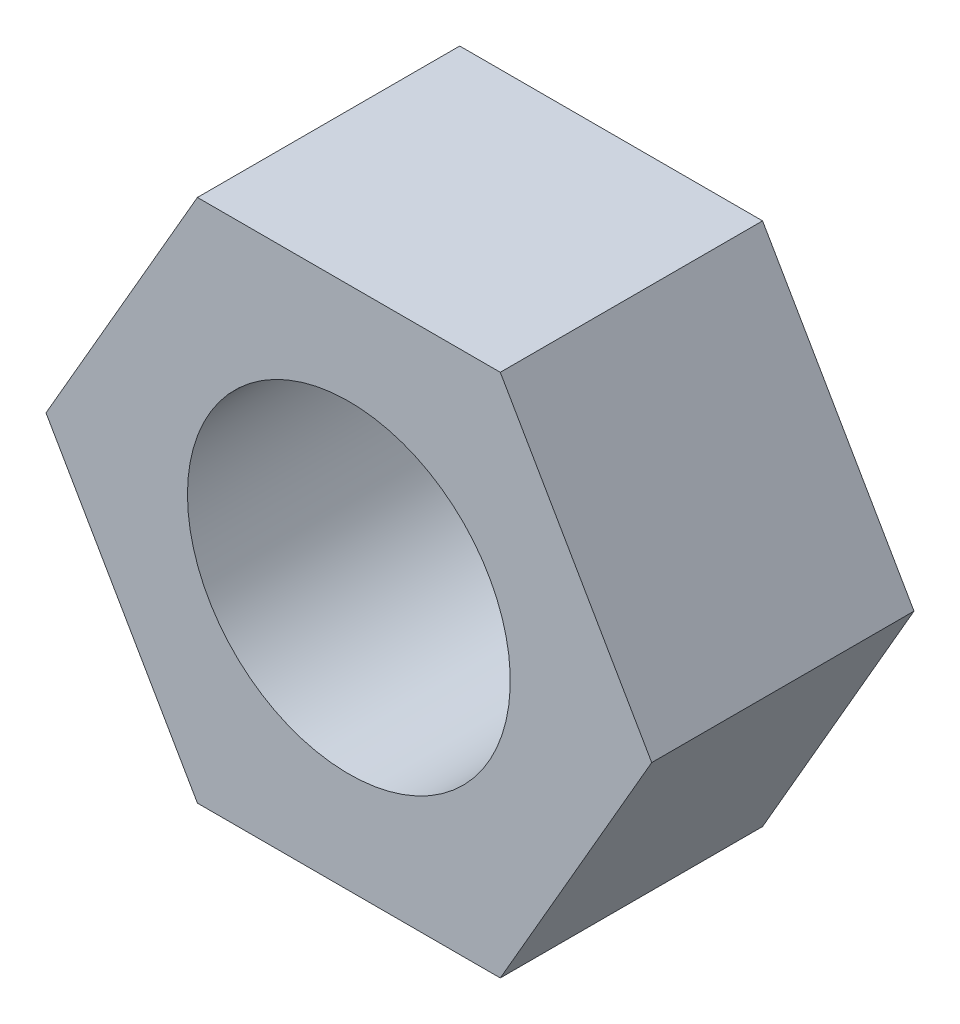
ISO-10303-21;
HEADER;
FILE_DESCRIPTION(('STEP AP214'),'2;1');
FILE_NAME('part.step','',(''),(''),'','','');
FILE_SCHEMA(('AUTOMOTIVE_DESIGN { 1 0 10303 214 1 1 1 1 }'));
ENDSEC;
DATA;
#1=APPLICATION_CONTEXT('core data for automotive mechanical design processes');
#2=APPLICATION_PROTOCOL_DEFINITION('international standard','automotive_design',2000,#1);
#3=PRODUCT_CONTEXT('',#1,'mechanical');
#4=PRODUCT('Part','Part','',(#3));
#5=PRODUCT_RELATED_PRODUCT_CATEGORY('part','',(#4));
#6=PRODUCT_DEFINITION_FORMATION('','',#4);
#7=PRODUCT_DEFINITION_CONTEXT('part definition',#1,'design');
#8=PRODUCT_DEFINITION('design','',#6,#7);
#9=PRODUCT_DEFINITION_SHAPE('','',#8);
#10=(LENGTH_UNIT() NAMED_UNIT(*) SI_UNIT(.MILLI.,.METRE.));
#11=(NAMED_UNIT(*) PLANE_ANGLE_UNIT() SI_UNIT($,.RADIAN.));
#12=(NAMED_UNIT(*) SI_UNIT($,.STERADIAN.) SOLID_ANGLE_UNIT());
#13=UNCERTAINTY_MEASURE_WITH_UNIT(LENGTH_MEASURE(1.E-05),#10,'distance_accuracy_value','');
#14=(GEOMETRIC_REPRESENTATION_CONTEXT(3) GLOBAL_UNCERTAINTY_ASSIGNED_CONTEXT((#13)) GLOBAL_UNIT_ASSIGNED_CONTEXT((#10,
#11,#12)) REPRESENTATION_CONTEXT('',''));
#15=CARTESIAN_POINT('',(0.,0.,0.));
#16=DIRECTION('',(0.,0.,1.));
#17=DIRECTION('',(1.,0.,0.));
#18=AXIS2_PLACEMENT_3D('',#15,#16,#17);
#19=CARTESIAN_POINT('',(5.62916512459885,-3.25,6.5));
#20=DIRECTION('',(-0.866025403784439,0.5,0.));
#21=DIRECTION('',(-0.5,-0.866025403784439,0.));
#22=AXIS2_PLACEMENT_3D('',#19,#20,#21);
#23=PLANE('',#22);
#24=DIRECTION('',(0.5,0.866025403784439,0.));
#25=VECTOR('',#24,1.);
#26=CARTESIAN_POINT('',(5.62916512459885,-3.25,0.));
#27=LINE('',#26,#25);
#28=CARTESIAN_POINT('',(3.75277674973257,-6.5,0.));
#29=VERTEX_POINT('',#28);
#30=CARTESIAN_POINT('',(7.50555349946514,0.,0.));
#31=VERTEX_POINT('',#30);
#32=EDGE_CURVE('E122',#29,#31,#27,.T.);
#33=ORIENTED_EDGE('',*,*,#32,.T.);
#34=DIRECTION('',(0.,0.,-1.));
#35=VECTOR('',#34,1.);
#36=CARTESIAN_POINT('',(7.50555349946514,0.,6.5));
#37=LINE('',#36,#35);
#38=CARTESIAN_POINT('',(7.50555349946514,0.,6.5));
#39=VERTEX_POINT('',#38);
#40=EDGE_CURVE('E11',#39,#31,#37,.T.);
#41=ORIENTED_EDGE('',*,*,#40,.F.);
#42=DIRECTION('',(0.5,0.866025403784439,0.));
#43=VECTOR('',#42,1.);
#44=CARTESIAN_POINT('',(5.62916512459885,-3.25,6.5));
#45=LINE('',#44,#43);
#46=CARTESIAN_POINT('',(3.75277674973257,-6.5,6.5));
#47=VERTEX_POINT('',#46);
#48=EDGE_CURVE('E145',#47,#39,#45,.T.);
#49=ORIENTED_EDGE('',*,*,#48,.F.);
#50=DIRECTION('',(0.,0.,-1.));
#51=VECTOR('',#50,1.);
#52=CARTESIAN_POINT('',(3.75277674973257,-6.5,6.5));
#53=LINE('',#52,#51);
#54=EDGE_CURVE('E115',#47,#29,#53,.T.);
#55=ORIENTED_EDGE('',*,*,#54,.T.);
#56=EDGE_LOOP('',(#33,#41,#49,#55));
#57=FACE_BOUND('',#56,.T.);
#58=ADVANCED_FACE('F34',(#57),#23,.F.);
#59=CARTESIAN_POINT('',(5.62916512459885,3.25,6.5));
#60=DIRECTION('',(-0.866025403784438,-0.5,0.));
#61=DIRECTION('',(0.5,-0.866025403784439,0.));
#62=AXIS2_PLACEMENT_3D('',#59,#60,#61);
#63=PLANE('',#62);
#64=DIRECTION('',(-0.5,0.866025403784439,0.));
#65=VECTOR('',#64,1.);
#66=CARTESIAN_POINT('',(5.62916512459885,3.25,0.));
#67=LINE('',#66,#65);
#68=CARTESIAN_POINT('',(3.75277674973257,6.5,0.));
#69=VERTEX_POINT('',#68);
#70=EDGE_CURVE('E125',#31,#69,#67,.T.);
#71=ORIENTED_EDGE('',*,*,#70,.T.);
#72=DIRECTION('',(0.,0.,-1.));
#73=VECTOR('',#72,1.);
#74=CARTESIAN_POINT('',(3.75277674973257,6.5,6.5));
#75=LINE('',#74,#73);
#76=CARTESIAN_POINT('',(3.75277674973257,6.5,6.5));
#77=VERTEX_POINT('',#76);
#78=EDGE_CURVE('E43',#77,#69,#75,.T.);
#79=ORIENTED_EDGE('',*,*,#78,.F.);
#80=DIRECTION('',(-0.5,0.866025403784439,0.));
#81=VECTOR('',#80,1.);
#82=CARTESIAN_POINT('',(5.62916512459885,3.25,6.5));
#83=LINE('',#82,#81);
#84=EDGE_CURVE('E88',#39,#77,#83,.T.);
#85=ORIENTED_EDGE('',*,*,#84,.F.);
#86=ORIENTED_EDGE('',*,*,#40,.T.);
#87=EDGE_LOOP('',(#71,#79,#85,#86));
#88=FACE_BOUND('',#87,.T.);
#89=ADVANCED_FACE('F159',(#88),#63,.F.);
#90=CARTESIAN_POINT('',(0.,6.5,6.5));
#91=DIRECTION('',(0.,-1.,0.));
#92=DIRECTION('',(1.,0.,0.));
#93=AXIS2_PLACEMENT_3D('',#90,#91,#92);
#94=PLANE('',#93);
#95=DIRECTION('',(-1.,0.,0.));
#96=VECTOR('',#95,1.);
#97=CARTESIAN_POINT('',(0.,6.5,0.));
#98=LINE('',#97,#96);
#99=CARTESIAN_POINT('',(-3.75277674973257,6.5,0.));
#100=VERTEX_POINT('',#99);
#101=EDGE_CURVE('E127',#69,#100,#98,.T.);
#102=ORIENTED_EDGE('',*,*,#101,.T.);
#103=DIRECTION('',(0.,0.,-1.));
#104=VECTOR('',#103,1.);
#105=CARTESIAN_POINT('',(-3.75277674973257,6.5,6.5));
#106=LINE('',#105,#104);
#107=CARTESIAN_POINT('',(-3.75277674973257,6.5,6.5));
#108=VERTEX_POINT('',#107);
#109=EDGE_CURVE('E110',#108,#100,#106,.T.);
#110=ORIENTED_EDGE('',*,*,#109,.F.);
#111=DIRECTION('',(-1.,0.,0.));
#112=VECTOR('',#111,1.);
#113=CARTESIAN_POINT('',(0.,6.5,6.5));
#114=LINE('',#113,#112);
#115=EDGE_CURVE('E101',#77,#108,#114,.T.);
#116=ORIENTED_EDGE('',*,*,#115,.F.);
#117=ORIENTED_EDGE('',*,*,#78,.T.);
#118=EDGE_LOOP('',(#102,#110,#116,#117));
#119=FACE_BOUND('',#118,.T.);
#120=ADVANCED_FACE('F138',(#119),#94,.F.);
#121=CARTESIAN_POINT('',(-5.62916512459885,3.24999999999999,6.5));
#122=DIRECTION('',(0.866025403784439,-0.499999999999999,0.));
#123=DIRECTION('',(0.499999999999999,0.866025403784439,0.));
#124=AXIS2_PLACEMENT_3D('',#121,#122,#123);
#125=PLANE('',#124);
#126=DIRECTION('',(-0.499999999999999,-0.866025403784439,0.));
#127=VECTOR('',#126,1.);
#128=CARTESIAN_POINT('',(-5.62916512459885,3.24999999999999,0.));
#129=LINE('',#128,#127);
#130=CARTESIAN_POINT('',(-7.50555349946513,0.,0.));
#131=VERTEX_POINT('',#130);
#132=EDGE_CURVE('E109',#100,#131,#129,.T.);
#133=ORIENTED_EDGE('',*,*,#132,.T.);
#134=DIRECTION('',(0.,0.,-1.));
#135=VECTOR('',#134,1.);
#136=CARTESIAN_POINT('',(-7.50555349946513,0.,6.5));
#137=LINE('',#136,#135);
#138=CARTESIAN_POINT('',(-7.50555349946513,0.,6.5));
#139=VERTEX_POINT('',#138);
#140=EDGE_CURVE('E106',#139,#131,#137,.T.);
#141=ORIENTED_EDGE('',*,*,#140,.F.);
#142=DIRECTION('',(-0.499999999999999,-0.866025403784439,0.));
#143=VECTOR('',#142,1.);
#144=CARTESIAN_POINT('',(-5.62916512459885,3.24999999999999,6.5));
#145=LINE('',#144,#143);
#146=EDGE_CURVE('E95',#108,#139,#145,.T.);
#147=ORIENTED_EDGE('',*,*,#146,.F.);
#148=ORIENTED_EDGE('',*,*,#109,.T.);
#149=EDGE_LOOP('',(#133,#141,#147,#148));
#150=FACE_BOUND('',#149,.T.);
#151=ADVANCED_FACE('F107',(#150),#125,.F.);
#152=CARTESIAN_POINT('',(-5.62916512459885,-3.25,6.5));
#153=DIRECTION('',(0.866025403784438,0.5,0.));
#154=DIRECTION('',(-0.5,0.866025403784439,0.));
#155=AXIS2_PLACEMENT_3D('',#152,#153,#154);
#156=PLANE('',#155);
#157=DIRECTION('',(0.5,-0.866025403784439,0.));
#158=VECTOR('',#157,1.);
#159=CARTESIAN_POINT('',(-5.62916512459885,-3.25,0.));
#160=LINE('',#159,#158);
#161=CARTESIAN_POINT('',(-3.75277674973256,-6.5,0.));
#162=VERTEX_POINT('',#161);
#163=EDGE_CURVE('E74',#131,#162,#160,.T.);
#164=ORIENTED_EDGE('',*,*,#163,.T.);
#165=DIRECTION('',(0.,0.,-1.));
#166=VECTOR('',#165,1.);
#167=CARTESIAN_POINT('',(-3.75277674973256,-6.5,6.5));
#168=LINE('',#167,#166);
#169=CARTESIAN_POINT('',(-3.75277674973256,-6.5,6.5));
#170=VERTEX_POINT('',#169);
#171=EDGE_CURVE('E111',#170,#162,#168,.T.);
#172=ORIENTED_EDGE('',*,*,#171,.F.);
#173=DIRECTION('',(0.5,-0.866025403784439,0.));
#174=VECTOR('',#173,1.);
#175=CARTESIAN_POINT('',(-5.62916512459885,-3.25,6.5));
#176=LINE('',#175,#174);
#177=EDGE_CURVE('E99',#139,#170,#176,.T.);
#178=ORIENTED_EDGE('',*,*,#177,.F.);
#179=ORIENTED_EDGE('',*,*,#140,.T.);
#180=EDGE_LOOP('',(#164,#172,#178,#179));
#181=FACE_BOUND('',#180,.T.);
#182=ADVANCED_FACE('F113',(#181),#156,.F.);
#183=CARTESIAN_POINT('',(0.,0.,6.5));
#184=DIRECTION('',(0.,0.,-1.));
#185=DIRECTION('',(-1.,0.,0.));
#186=AXIS2_PLACEMENT_3D('',#183,#184,#185);
#187=CYLINDRICAL_SURFACE('',#186,4.);
#188=CARTESIAN_POINT('',(0.,0.,6.5));
#189=DIRECTION('',(0.,0.,1.));
#190=DIRECTION('',(1.,0.,0.));
#191=AXIS2_PLACEMENT_3D('',#188,#189,#190);
#192=CIRCLE('',#191,4.);
#193=CARTESIAN_POINT('',(-4.,0.,6.5));
#194=VERTEX_POINT('',#193);
#195=EDGE_CURVE('E132',#194,#194,#192,.T.);
#196=CARTESIAN_POINT('',(0.,0.,0.));
#197=DIRECTION('',(0.,0.,1.));
#198=DIRECTION('',(1.,0.,0.));
#199=AXIS2_PLACEMENT_3D('',#196,#197,#198);
#200=CIRCLE('',#199,4.);
#201=CARTESIAN_POINT('',(-4.,0.,0.));
#202=VERTEX_POINT('',#201);
#203=EDGE_CURVE('E119',#202,#202,#200,.T.);
#204=CARTESIAN_POINT('',(-4.,0.,6.5));
#205=CARTESIAN_POINT('',(-4.,0.,6.43229166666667));
#206=CARTESIAN_POINT('',(-4.,0.,6.36458333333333));
#207=CARTESIAN_POINT('',(-4.,0.,6.22916666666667));
#208=CARTESIAN_POINT('',(-4.,0.,6.16145833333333));
#209=CARTESIAN_POINT('',(-4.,0.,6.02604166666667));
#210=CARTESIAN_POINT('',(-4.,0.,5.95833333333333));
#211=CARTESIAN_POINT('',(-4.,0.,5.82291666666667));
#212=CARTESIAN_POINT('',(-4.,0.,5.75520833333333));
#213=CARTESIAN_POINT('',(-4.,0.,5.61979166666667));
#214=CARTESIAN_POINT('',(-4.,0.,5.55208333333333));
#215=CARTESIAN_POINT('',(-4.,0.,5.41666666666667));
#216=CARTESIAN_POINT('',(-4.,0.,5.34895833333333));
#217=CARTESIAN_POINT('',(-4.,0.,5.21354166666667));
#218=CARTESIAN_POINT('',(-4.,0.,5.14583333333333));
#219=CARTESIAN_POINT('',(-4.,0.,5.01041666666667));
#220=CARTESIAN_POINT('',(-4.,0.,4.94270833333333));
#221=CARTESIAN_POINT('',(-4.,0.,4.80729166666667));
#222=CARTESIAN_POINT('',(-4.,0.,4.73958333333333));
#223=CARTESIAN_POINT('',(-4.,0.,4.60416666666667));
#224=CARTESIAN_POINT('',(-4.,0.,4.53645833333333));
#225=CARTESIAN_POINT('',(-4.,0.,4.40104166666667));
#226=CARTESIAN_POINT('',(-4.,0.,4.33333333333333));
#227=CARTESIAN_POINT('',(-4.,0.,4.19791666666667));
#228=CARTESIAN_POINT('',(-4.,0.,4.13020833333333));
#229=CARTESIAN_POINT('',(-4.,0.,3.99479166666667));
#230=CARTESIAN_POINT('',(-4.,0.,3.92708333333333));
#231=CARTESIAN_POINT('',(-4.,0.,3.79166666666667));
#232=CARTESIAN_POINT('',(-4.,0.,3.72395833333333));
#233=CARTESIAN_POINT('',(-4.,0.,3.58854166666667));
#234=CARTESIAN_POINT('',(-4.,0.,3.52083333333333));
#235=CARTESIAN_POINT('',(-4.,0.,3.38541666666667));
#236=CARTESIAN_POINT('',(-4.,0.,3.31770833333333));
#237=CARTESIAN_POINT('',(-4.,0.,3.18229166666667));
#238=CARTESIAN_POINT('',(-4.,0.,3.11458333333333));
#239=CARTESIAN_POINT('',(-4.,0.,2.97916666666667));
#240=CARTESIAN_POINT('',(-4.,0.,2.91145833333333));
#241=CARTESIAN_POINT('',(-4.,0.,2.77604166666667));
#242=CARTESIAN_POINT('',(-4.,0.,2.70833333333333));
#243=CARTESIAN_POINT('',(-4.,0.,2.57291666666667));
#244=CARTESIAN_POINT('',(-4.,0.,2.50520833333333));
#245=CARTESIAN_POINT('',(-4.,0.,2.36979166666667));
#246=CARTESIAN_POINT('',(-4.,0.,2.30208333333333));
#247=CARTESIAN_POINT('',(-4.,0.,2.16666666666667));
#248=CARTESIAN_POINT('',(-4.,0.,2.09895833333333));
#249=CARTESIAN_POINT('',(-4.,0.,1.96354166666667));
#250=CARTESIAN_POINT('',(-4.,0.,1.89583333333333));
#251=CARTESIAN_POINT('',(-4.,0.,1.76041666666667));
#252=CARTESIAN_POINT('',(-4.,0.,1.69270833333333));
#253=CARTESIAN_POINT('',(-4.,0.,1.55729166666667));
#254=CARTESIAN_POINT('',(-4.,0.,1.48958333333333));
#255=CARTESIAN_POINT('',(-4.,0.,1.35416666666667));
#256=CARTESIAN_POINT('',(-4.,0.,1.28645833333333));
#257=CARTESIAN_POINT('',(-4.,0.,1.15104166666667));
#258=CARTESIAN_POINT('',(-4.,0.,1.08333333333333));
#259=CARTESIAN_POINT('',(-4.,0.,0.947916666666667));
#260=CARTESIAN_POINT('',(-4.,0.,0.880208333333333));
#261=CARTESIAN_POINT('',(-4.,0.,0.744791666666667));
#262=CARTESIAN_POINT('',(-4.,0.,0.677083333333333));
#263=CARTESIAN_POINT('',(-4.,0.,0.541666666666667));
#264=CARTESIAN_POINT('',(-4.,0.,0.473958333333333));
#265=CARTESIAN_POINT('',(-4.,0.,0.338541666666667));
#266=CARTESIAN_POINT('',(-4.,0.,0.270833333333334));
#267=CARTESIAN_POINT('',(-4.,0.,0.135416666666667));
#268=CARTESIAN_POINT('',(-4.,0.,0.0677083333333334));
#269=CARTESIAN_POINT('',(-4.,0.,0.));
#270=B_SPLINE_CURVE_WITH_KNOTS('',3,(#204,#205,#206,#207,#208,#209,#210,#211,#212,#213,#214,
#215,#216,#217,#218,#219,#220,#221,#222,#223,#224,#225,#226,#227,#228,#229,#230,#231,#232,#233,
#234,#235,#236,#237,#238,#239,#240,#241,#242,#243,#244,#245,#246,#247,#248,#249,#250,#251,#252,
#253,#254,#255,#256,#257,#258,#259,#260,#261,#262,#263,#264,#265,#266,#267,#268,#269),
.UNSPECIFIED.,.F.,.F.,(4,2,2,2,2,2,2,2,2,2,2,2,2,2,2,2,2,2,2,2,2,2,2,2,2,2,2,2,2,2,2,2,4),(0.,
0.203125,0.40625,0.609375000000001,0.812500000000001,1.015625,1.21875,1.421875,1.625,1.828125,
2.03125,2.234375,2.4375,2.640625,2.84375,3.046875,3.25,3.453125,3.65625,3.859375,4.0625,
4.265625,4.46875,4.671875,4.875,5.078125,5.28125,5.484375,5.6875,5.890625,6.09375,6.296875,6.5),.UNSPECIFIED.);
#271=EDGE_CURVE('BSEAM36',#194,#202,#270,.T.);
#272=ORIENTED_EDGE('',*,*,#195,.T.);
#273=ORIENTED_EDGE('',*,*,#203,.F.);
#274=ORIENTED_EDGE('',*,*,#271,.T.);
#275=ORIENTED_EDGE('',*,*,#271,.F.);
#276=EDGE_LOOP('',(#272,#274,#273,#275));
#277=FACE_BOUND('',#276,.T.);
#278=ADVANCED_FACE('F36',(#277),#187,.F.);
#279=CARTESIAN_POINT('',(0.,-6.5,6.5));
#280=DIRECTION('',(0.,1.,0.));
#281=DIRECTION('',(-1.,0.,0.));
#282=AXIS2_PLACEMENT_3D('',#279,#280,#281);
#283=PLANE('',#282);
#284=DIRECTION('',(1.,0.,0.));
#285=VECTOR('',#284,1.);
#286=CARTESIAN_POINT('',(0.,-6.5,0.));
#287=LINE('',#286,#285);
#288=EDGE_CURVE('E80',#162,#29,#287,.T.);
#289=ORIENTED_EDGE('',*,*,#288,.T.);
#290=ORIENTED_EDGE('',*,*,#54,.F.);
#291=DIRECTION('',(1.,0.,0.));
#292=VECTOR('',#291,1.);
#293=CARTESIAN_POINT('',(0.,-6.5,6.5));
#294=LINE('',#293,#292);
#295=EDGE_CURVE('E51',#170,#47,#294,.T.);
#296=ORIENTED_EDGE('',*,*,#295,.F.);
#297=ORIENTED_EDGE('',*,*,#171,.T.);
#298=EDGE_LOOP('',(#289,#290,#296,#297));
#299=FACE_BOUND('',#298,.T.);
#300=ADVANCED_FACE('F146',(#299),#283,.F.);
#301=CARTESIAN_POINT('',(0.,0.,6.5));
#302=DIRECTION('',(0.,0.,1.));
#303=DIRECTION('',(1.,0.,0.));
#304=AXIS2_PLACEMENT_3D('',#301,#302,#303);
#305=PLANE('',#304);
#306=ORIENTED_EDGE('',*,*,#195,.F.);
#307=EDGE_LOOP('',(#306));
#308=FACE_BOUND('',#307,.T.);
#309=ORIENTED_EDGE('',*,*,#48,.T.);
#310=ORIENTED_EDGE('',*,*,#84,.T.);
#311=ORIENTED_EDGE('',*,*,#115,.T.);
#312=ORIENTED_EDGE('',*,*,#146,.T.);
#313=ORIENTED_EDGE('',*,*,#177,.T.);
#314=ORIENTED_EDGE('',*,*,#295,.T.);
#315=EDGE_LOOP('',(#309,#310,#311,#312,#313,#314));
#316=FACE_BOUND('',#315,.T.);
#317=ADVANCED_FACE('F97',(#308,#316),#305,.T.);
#318=CARTESIAN_POINT('',(0.,0.,0.));
#319=DIRECTION('',(0.,0.,1.));
#320=DIRECTION('',(1.,0.,0.));
#321=AXIS2_PLACEMENT_3D('',#318,#319,#320);
#322=PLANE('',#321);
#323=ORIENTED_EDGE('',*,*,#203,.T.);
#324=EDGE_LOOP('',(#323));
#325=FACE_BOUND('',#324,.T.);
#326=ORIENTED_EDGE('',*,*,#32,.F.);
#327=ORIENTED_EDGE('',*,*,#288,.F.);
#328=ORIENTED_EDGE('',*,*,#163,.F.);
#329=ORIENTED_EDGE('',*,*,#132,.F.);
#330=ORIENTED_EDGE('',*,*,#101,.F.);
#331=ORIENTED_EDGE('',*,*,#70,.F.);
#332=EDGE_LOOP('',(#326,#327,#328,#329,#330,#331));
#333=FACE_BOUND('',#332,.T.);
#334=ADVANCED_FACE('F141',(#325,#333),#322,.F.);
#335=CLOSED_SHELL('',(#58,#89,#120,#151,#182,#278,#300,#317,#334));
#336=MANIFOLD_SOLID_BREP('B2',#335);
#337=ADVANCED_BREP_SHAPE_REPRESENTATION('',(#18,#336),#14);
#338=SHAPE_DEFINITION_REPRESENTATION(#9,#337);
ENDSEC;
END-ISO-10303-21;
